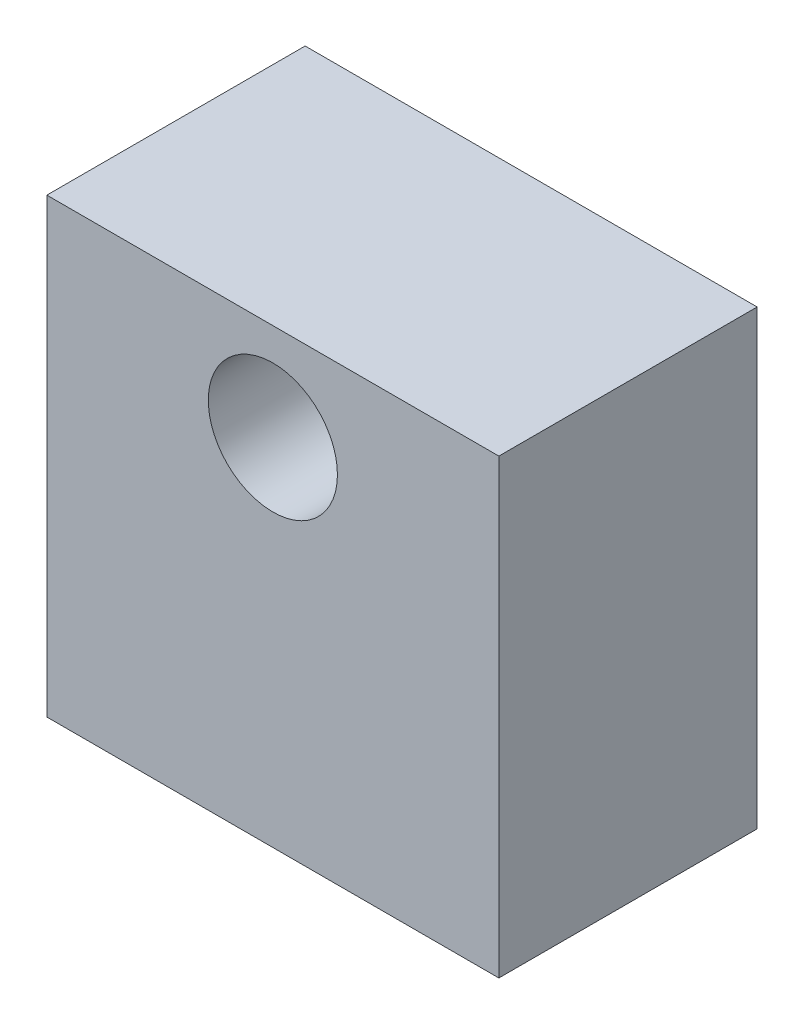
ISO-10303-21;
HEADER;
FILE_DESCRIPTION(('STEP AP214'),'2;1');
FILE_NAME('part.step','',(''),(''),'','','');
FILE_SCHEMA(('AUTOMOTIVE_DESIGN { 1 0 10303 214 1 1 1 1 }'));
ENDSEC;
DATA;
#1=APPLICATION_CONTEXT('core data for automotive mechanical design processes');
#2=APPLICATION_PROTOCOL_DEFINITION('international standard','automotive_design',2000,#1);
#3=PRODUCT_CONTEXT('',#1,'mechanical');
#4=PRODUCT('Part','Part','',(#3));
#5=PRODUCT_RELATED_PRODUCT_CATEGORY('part','',(#4));
#6=PRODUCT_DEFINITION_FORMATION('','',#4);
#7=PRODUCT_DEFINITION_CONTEXT('part definition',#1,'design');
#8=PRODUCT_DEFINITION('design','',#6,#7);
#9=PRODUCT_DEFINITION_SHAPE('','',#8);
#10=(LENGTH_UNIT() NAMED_UNIT(*) SI_UNIT(.MILLI.,.METRE.));
#11=(NAMED_UNIT(*) PLANE_ANGLE_UNIT() SI_UNIT($,.RADIAN.));
#12=(NAMED_UNIT(*) SI_UNIT($,.STERADIAN.) SOLID_ANGLE_UNIT());
#13=UNCERTAINTY_MEASURE_WITH_UNIT(LENGTH_MEASURE(1.E-05),#10,'distance_accuracy_value','');
#14=(GEOMETRIC_REPRESENTATION_CONTEXT(3) GLOBAL_UNCERTAINTY_ASSIGNED_CONTEXT((#13)) GLOBAL_UNIT_ASSIGNED_CONTEXT((#10,
#11,#12)) REPRESENTATION_CONTEXT('',''));
#15=CARTESIAN_POINT('',(0.,0.,0.));
#16=DIRECTION('',(0.,0.,1.));
#17=DIRECTION('',(1.,0.,0.));
#18=AXIS2_PLACEMENT_3D('',#15,#16,#17);
#19=CARTESIAN_POINT('',(0.,0.,40.));
#20=DIRECTION('',(0.,0.,1.));
#21=DIRECTION('',(1.,0.,0.));
#22=AXIS2_PLACEMENT_3D('',#19,#20,#21);
#23=PLANE('',#22);
#24=DIRECTION('',(0.,1.,0.));
#25=VECTOR('',#24,1.);
#26=CARTESIAN_POINT('',(35.,35.,40.));
#27=LINE('',#26,#25);
#28=CARTESIAN_POINT('',(35.,-35.,40.));
#29=VERTEX_POINT('',#28);
#30=CARTESIAN_POINT('',(35.,35.,40.));
#31=VERTEX_POINT('',#30);
#32=EDGE_CURVE('E87',#29,#31,#27,.T.);
#33=ORIENTED_EDGE('',*,*,#32,.T.);
#34=DIRECTION('',(-1.,0.,0.));
#35=VECTOR('',#34,1.);
#36=CARTESIAN_POINT('',(-35.,35.,40.));
#37=LINE('',#36,#35);
#38=CARTESIAN_POINT('',(-35.,35.,40.));
#39=VERTEX_POINT('',#38);
#40=EDGE_CURVE('E82',#31,#39,#37,.T.);
#41=ORIENTED_EDGE('',*,*,#40,.T.);
#42=DIRECTION('',(0.,-1.,0.));
#43=VECTOR('',#42,1.);
#44=CARTESIAN_POINT('',(-35.,35.,40.));
#45=LINE('',#44,#43);
#46=CARTESIAN_POINT('',(-35.,-35.,40.));
#47=VERTEX_POINT('',#46);
#48=EDGE_CURVE('E85',#39,#47,#45,.T.);
#49=ORIENTED_EDGE('',*,*,#48,.T.);
#50=DIRECTION('',(1.,0.,0.));
#51=VECTOR('',#50,1.);
#52=CARTESIAN_POINT('',(-35.,-35.,40.));
#53=LINE('',#52,#51);
#54=EDGE_CURVE('E52',#47,#29,#53,.T.);
#55=ORIENTED_EDGE('',*,*,#54,.T.);
#56=EDGE_LOOP('',(#33,#41,#49,#55));
#57=FACE_BOUND('',#56,.T.);
#58=CARTESIAN_POINT('',(0.,20.,40.));
#59=DIRECTION('',(0.,0.,1.));
#60=DIRECTION('',(1.,0.,0.));
#61=AXIS2_PLACEMENT_3D('',#58,#59,#60);
#62=CIRCLE('',#61,10.);
#63=CARTESIAN_POINT('',(9.99999999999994,20.,40.));
#64=VERTEX_POINT('',#63);
#65=EDGE_CURVE('E102',#64,#64,#62,.T.);
#66=ORIENTED_EDGE('',*,*,#65,.F.);
#67=EDGE_LOOP('',(#66));
#68=FACE_BOUND('',#67,.T.);
#69=ADVANCED_FACE('F35',(#57,#68),#23,.T.);
#70=CARTESIAN_POINT('',(0.,0.,0.));
#71=DIRECTION('',(0.,0.,1.));
#72=DIRECTION('',(1.,0.,0.));
#73=AXIS2_PLACEMENT_3D('',#70,#71,#72);
#74=PLANE('',#73);
#75=DIRECTION('',(0.,1.,0.));
#76=VECTOR('',#75,1.);
#77=CARTESIAN_POINT('',(35.,35.,0.));
#78=LINE('',#77,#76);
#79=CARTESIAN_POINT('',(35.,-35.,0.));
#80=VERTEX_POINT('',#79);
#81=CARTESIAN_POINT('',(35.,35.,0.));
#82=VERTEX_POINT('',#81);
#83=EDGE_CURVE('E99',#80,#82,#78,.T.);
#84=ORIENTED_EDGE('',*,*,#83,.F.);
#85=DIRECTION('',(1.,0.,0.));
#86=VECTOR('',#85,1.);
#87=CARTESIAN_POINT('',(-35.,-35.,0.));
#88=LINE('',#87,#86);
#89=CARTESIAN_POINT('',(-35.,-35.,0.));
#90=VERTEX_POINT('',#89);
#91=EDGE_CURVE('E75',#90,#80,#88,.T.);
#92=ORIENTED_EDGE('',*,*,#91,.F.);
#93=DIRECTION('',(0.,-1.,0.));
#94=VECTOR('',#93,1.);
#95=CARTESIAN_POINT('',(-35.,35.,0.));
#96=LINE('',#95,#94);
#97=CARTESIAN_POINT('',(-35.,35.,0.));
#98=VERTEX_POINT('',#97);
#99=EDGE_CURVE('E69',#98,#90,#96,.T.);
#100=ORIENTED_EDGE('',*,*,#99,.F.);
#101=DIRECTION('',(-1.,0.,0.));
#102=VECTOR('',#101,1.);
#103=CARTESIAN_POINT('',(-35.,35.,0.));
#104=LINE('',#103,#102);
#105=EDGE_CURVE('E91',#82,#98,#104,.T.);
#106=ORIENTED_EDGE('',*,*,#105,.F.);
#107=EDGE_LOOP('',(#84,#92,#100,#106));
#108=FACE_BOUND('',#107,.T.);
#109=CARTESIAN_POINT('',(0.,20.,0.));
#110=DIRECTION('',(0.,0.,1.));
#111=DIRECTION('',(1.,0.,0.));
#112=AXIS2_PLACEMENT_3D('',#109,#110,#111);
#113=CIRCLE('',#112,10.);
#114=CARTESIAN_POINT('',(9.99999999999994,20.,0.));
#115=VERTEX_POINT('',#114);
#116=EDGE_CURVE('E114',#115,#115,#113,.T.);
#117=ORIENTED_EDGE('',*,*,#116,.T.);
#118=EDGE_LOOP('',(#117));
#119=FACE_BOUND('',#118,.T.);
#120=ADVANCED_FACE('F110',(#108,#119),#74,.F.);
#121=CARTESIAN_POINT('',(35.,35.,40.));
#122=DIRECTION('',(-1.,0.,0.));
#123=DIRECTION('',(0.,-1.,0.));
#124=AXIS2_PLACEMENT_3D('',#121,#122,#123);
#125=PLANE('',#124);
#126=ORIENTED_EDGE('',*,*,#83,.T.);
#127=DIRECTION('',(0.,0.,-1.));
#128=VECTOR('',#127,1.);
#129=CARTESIAN_POINT('',(35.,35.,40.));
#130=LINE('',#129,#128);
#131=EDGE_CURVE('E11',#31,#82,#130,.T.);
#132=ORIENTED_EDGE('',*,*,#131,.F.);
#133=ORIENTED_EDGE('',*,*,#32,.F.);
#134=DIRECTION('',(0.,0.,-1.));
#135=VECTOR('',#134,1.);
#136=CARTESIAN_POINT('',(35.,-35.,40.));
#137=LINE('',#136,#135);
#138=EDGE_CURVE('E95',#29,#80,#137,.T.);
#139=ORIENTED_EDGE('',*,*,#138,.T.);
#140=EDGE_LOOP('',(#126,#132,#133,#139));
#141=FACE_BOUND('',#140,.T.);
#142=ADVANCED_FACE('F37',(#141),#125,.F.);
#143=CARTESIAN_POINT('',(-35.,35.,40.));
#144=DIRECTION('',(0.,-1.,0.));
#145=DIRECTION('',(1.,0.,0.));
#146=AXIS2_PLACEMENT_3D('',#143,#144,#145);
#147=PLANE('',#146);
#148=ORIENTED_EDGE('',*,*,#105,.T.);
#149=DIRECTION('',(0.,0.,-1.));
#150=VECTOR('',#149,1.);
#151=CARTESIAN_POINT('',(-35.,35.,40.));
#152=LINE('',#151,#150);
#153=EDGE_CURVE('E44',#39,#98,#152,.T.);
#154=ORIENTED_EDGE('',*,*,#153,.F.);
#155=ORIENTED_EDGE('',*,*,#40,.F.);
#156=ORIENTED_EDGE('',*,*,#131,.T.);
#157=EDGE_LOOP('',(#148,#154,#155,#156));
#158=FACE_BOUND('',#157,.T.);
#159=ADVANCED_FACE('F90',(#158),#147,.F.);
#160=CARTESIAN_POINT('',(-35.,35.,40.));
#161=DIRECTION('',(1.,0.,0.));
#162=DIRECTION('',(0.,1.,0.));
#163=AXIS2_PLACEMENT_3D('',#160,#161,#162);
#164=PLANE('',#163);
#165=ORIENTED_EDGE('',*,*,#99,.T.);
#166=DIRECTION('',(0.,0.,-1.));
#167=VECTOR('',#166,1.);
#168=CARTESIAN_POINT('',(-35.,-35.,40.));
#169=LINE('',#168,#167);
#170=EDGE_CURVE('E92',#47,#90,#169,.T.);
#171=ORIENTED_EDGE('',*,*,#170,.F.);
#172=ORIENTED_EDGE('',*,*,#48,.F.);
#173=ORIENTED_EDGE('',*,*,#153,.T.);
#174=EDGE_LOOP('',(#165,#171,#172,#173));
#175=FACE_BOUND('',#174,.T.);
#176=ADVANCED_FACE('F93',(#175),#164,.F.);
#177=CARTESIAN_POINT('',(-35.,-35.,40.));
#178=DIRECTION('',(0.,1.,0.));
#179=DIRECTION('',(0.,0.,1.));
#180=AXIS2_PLACEMENT_3D('',#177,#178,#179);
#181=PLANE('',#180);
#182=ORIENTED_EDGE('',*,*,#91,.T.);
#183=ORIENTED_EDGE('',*,*,#138,.F.);
#184=ORIENTED_EDGE('',*,*,#54,.F.);
#185=ORIENTED_EDGE('',*,*,#170,.T.);
#186=EDGE_LOOP('',(#182,#183,#184,#185));
#187=FACE_BOUND('',#186,.T.);
#188=ADVANCED_FACE('F107',(#187),#181,.F.);
#189=CARTESIAN_POINT('',(0.,20.,40.));
#190=DIRECTION('',(0.,0.,-1.));
#191=DIRECTION('',(-1.,0.,0.));
#192=AXIS2_PLACEMENT_3D('',#189,#190,#191);
#193=CYLINDRICAL_SURFACE('',#192,10.);
#194=ORIENTED_EDGE('',*,*,#65,.T.);
#195=EDGE_LOOP('',(#194));
#196=FACE_BOUND('',#195,.T.);
#197=ORIENTED_EDGE('',*,*,#116,.F.);
#198=EDGE_LOOP('',(#197));
#199=FACE_BOUND('',#198,.T.);
#200=ADVANCED_FACE('F120',(#196,#199),#193,.F.);
#201=CLOSED_SHELL('',(#69,#120,#142,#159,#176,#188,#200));
#202=MANIFOLD_SOLID_BREP('B2',#201);
#203=ADVANCED_BREP_SHAPE_REPRESENTATION('',(#18,#202),#14);
#204=SHAPE_DEFINITION_REPRESENTATION(#9,#203);
ENDSEC;
END-ISO-10303-21;
